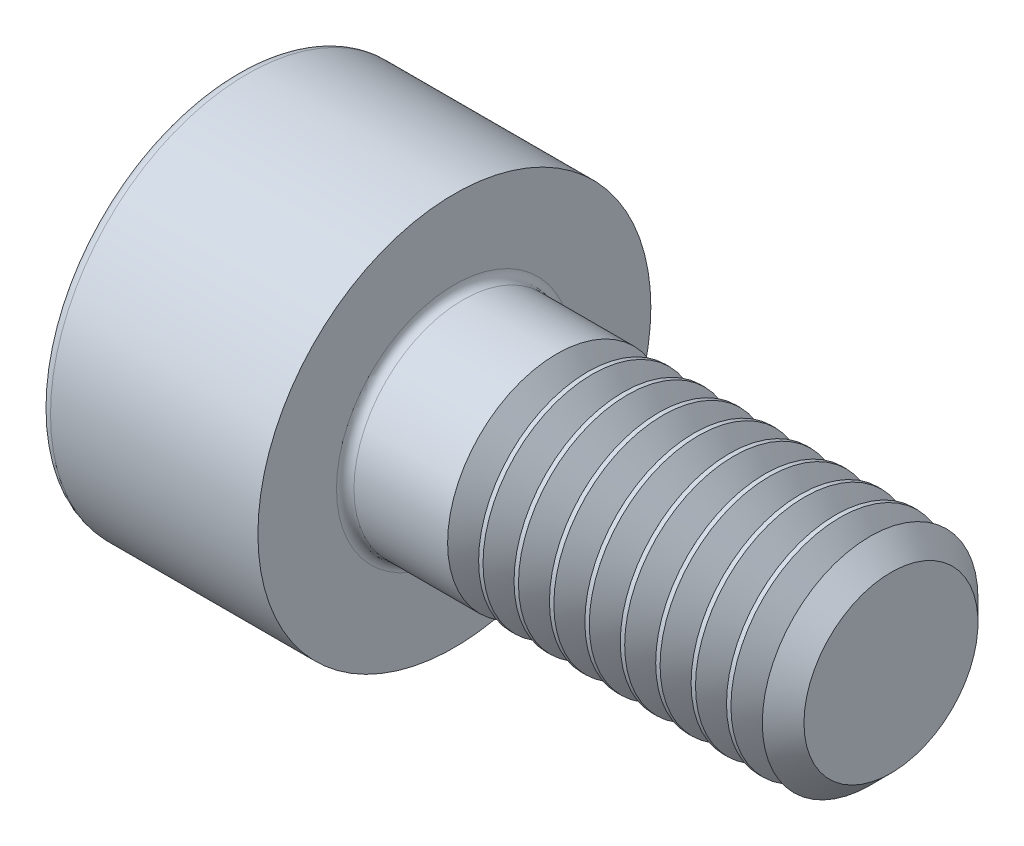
from build123d import *

# Parameters (mm, degrees)
FILLET1_R       = 0.1
FILLET2_R       = 0.125
HEX_2_DEPTH     = 1.1
THDSCHPAT_COUNT = 9
THDSCHPAT_PITCH = 0.405555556


with BuildPart() as part:
    # BodySke → Base-Revolve (revolve)
    with BuildSketch(Plane.XY, mode=Mode.PRIVATE) as base_revolve_sk:
        Polygon((0, 0), (0, 2.25), (2.5, 2.25), (2.5, 1.25), (7.2465, 1.25), (7.5, 0.9965), (7.5, 0), align=None)
    revolve(base_revolve_sk.sketch.rotate(Axis((-31.75, 0, 0), (1, 0, 0)), 90), axis=Axis((-31.75, 0, 0), (1, 0, 0)))

    # Fillet1
    fillet1_edges = [part.edges().sort_by_distance(p)[0] for p in [
        (2.5, 0, -1.25),
    ]]
    fillet(fillet1_edges, radius=FILLET1_R)

    # Fillet2
    fillet2_edges = [part.edges().sort_by_distance(p)[0] for p in [
        (0, 0, -2.25),
    ]]
    fillet(fillet2_edges, radius=FILLET2_R)

    # Sketch2 → Hex-PreBroach (revolve, cut)
    with BuildSketch(Plane.XY, mode=Mode.PRIVATE) as hex_prebroach_sk:
        Polygon((0, 1.0225), (1.1, 1.0225), (1.69034065, 0), (0, 0), align=None)
    revolve(hex_prebroach_sk.sketch.rotate(Axis((0, 0, 0), (1, 0, 0)), 90), axis=Axis((0, 0, 0), (1, 0, 0)), mode=Mode.SUBTRACT)

    # Sketch3 → Hex 2 (cut)
    with BuildSketch(Plane(origin=(0, 0, 0), x_dir=(0, 0.500000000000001, 0.866025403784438), z_dir=(-1, 0, 0))):
        Polygon((0.59034065, 1.0225), (-0.59034065, 1.0225), (-1.1806813, 0), (-0.59034065, -1.0225), (0.59034065, -1.0225), (1.1806813, 0), align=None)
    extrude(amount=-HEX_2_DEPTH, mode=Mode.SUBTRACT)

    # ThdSchSke → ThreadSchematic (revolve, cut)
    with BuildSketch(Plane.XY):
        Polygon((3.85, -0.9965), (3.672497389, -1.25), (3.672497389, -1.5625), (4.027502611, -1.5625), (4.027502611, -1.25), align=None)
    threadschematic = revolve(axis=Axis((-3.175, 0, 0), (1, 0, 0)), mode=Mode.SUBTRACT)

    # ThdSchPat: ThreadSchematic ×9
    with Locations(*[(i * THDSCHPAT_PITCH, 0, 0) for i in range(1, THDSCHPAT_COUNT)]):
        add(threadschematic, mode=Mode.SUBTRACT)


solid = part.part
